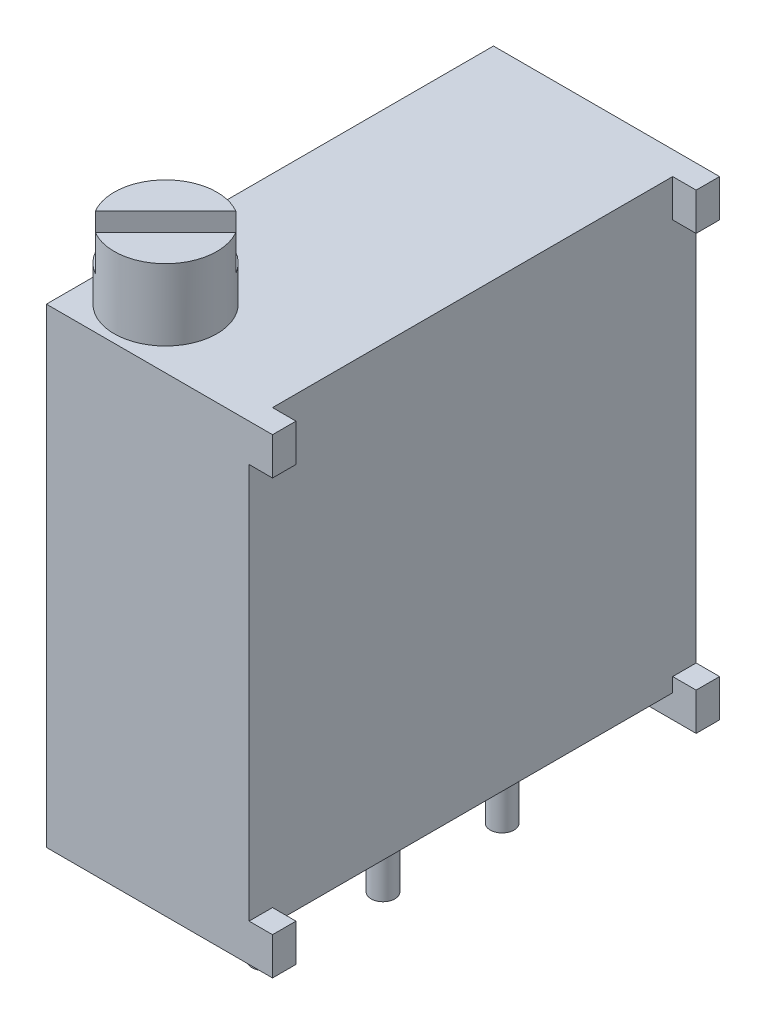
ISO-10303-21;
HEADER;
FILE_DESCRIPTION(('STEP AP214'),'2;1');
FILE_NAME('part.step','',(''),(''),'','','');
FILE_SCHEMA(('AUTOMOTIVE_DESIGN { 1 0 10303 214 1 1 1 1 }'));
ENDSEC;
DATA;
#1=APPLICATION_CONTEXT('core data for automotive mechanical design processes');
#2=APPLICATION_PROTOCOL_DEFINITION('international standard','automotive_design',2000,#1);
#3=PRODUCT_CONTEXT('',#1,'mechanical');
#4=PRODUCT('Part','Part','',(#3));
#5=PRODUCT_RELATED_PRODUCT_CATEGORY('part','',(#4));
#6=PRODUCT_DEFINITION_FORMATION('','',#4);
#7=PRODUCT_DEFINITION_CONTEXT('part definition',#1,'design');
#8=PRODUCT_DEFINITION('design','',#6,#7);
#9=PRODUCT_DEFINITION_SHAPE('','',#8);
#10=(LENGTH_UNIT() NAMED_UNIT(*) SI_UNIT(.MILLI.,.METRE.));
#11=(NAMED_UNIT(*) PLANE_ANGLE_UNIT() SI_UNIT($,.RADIAN.));
#12=(NAMED_UNIT(*) SI_UNIT($,.STERADIAN.) SOLID_ANGLE_UNIT());
#13=UNCERTAINTY_MEASURE_WITH_UNIT(LENGTH_MEASURE(1.E-05),#10,'distance_accuracy_value','');
#14=(GEOMETRIC_REPRESENTATION_CONTEXT(3) GLOBAL_UNCERTAINTY_ASSIGNED_CONTEXT((#13)) GLOBAL_UNIT_ASSIGNED_CONTEXT((#10,
#11,#12)) REPRESENTATION_CONTEXT('',''));
#15=CARTESIAN_POINT('',(0.,0.,0.));
#16=DIRECTION('',(0.,0.,1.));
#17=DIRECTION('',(1.,0.,0.));
#18=AXIS2_PLACEMENT_3D('',#15,#16,#17);
#19=CARTESIAN_POINT('',(-1.14,11.55,0.954999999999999));
#20=DIRECTION('',(0.,1.,0.));
#21=DIRECTION('',(0.,0.,1.));
#22=AXIS2_PLACEMENT_3D('',#19,#20,#21);
#23=PLANE('',#22);
#24=DIRECTION('',(-0.707106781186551,0.,0.707106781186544));
#25=VECTOR('',#24,1.);
#26=CARTESIAN_POINT('',(-1.33798989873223,11.55,0.757010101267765));
#27=LINE('',#26,#25);
#28=CARTESIAN_POINT('',(-0.589449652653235,11.55,0.00846985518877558));
#29=VERTEX_POINT('',#28);
#30=CARTESIAN_POINT('',(-2.08653014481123,11.55,1.50555034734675));
#31=VERTEX_POINT('',#30);
#32=EDGE_CURVE('E186',#29,#31,#27,.T.);
#33=ORIENTED_EDGE('',*,*,#32,.F.);
#34=CARTESIAN_POINT('',(-1.14,11.55,0.954999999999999));
#35=DIRECTION('',(0.,1.,0.));
#36=DIRECTION('',(0.,0.,1.));
#37=AXIS2_PLACEMENT_3D('',#34,#35,#36);
#38=CIRCLE('',#37,1.095);
#39=EDGE_CURVE('E198',#29,#31,#38,.T.);
#40=ORIENTED_EDGE('',*,*,#39,.T.);
#41=EDGE_LOOP('',(#33,#40));
#42=FACE_BOUND('',#41,.T.);
#43=ADVANCED_FACE('F31',(#42),#23,.T.);
#44=CARTESIAN_POINT('',(2.41,10.03,2.225));
#45=DIRECTION('',(0.,-1.,0.));
#46=DIRECTION('',(0.,0.,-1.));
#47=AXIS2_PLACEMENT_3D('',#44,#45,#46);
#48=PLANE('',#47);
#49=DIRECTION('',(1.,0.,0.));
#50=VECTOR('',#49,1.);
#51=CARTESIAN_POINT('',(1.91,10.03,1.725));
#52=LINE('',#51,#50);
#53=CARTESIAN_POINT('',(1.91,10.03,1.725));
#54=VERTEX_POINT('',#53);
#55=CARTESIAN_POINT('',(2.41,10.03,1.725));
#56=VERTEX_POINT('',#55);
#57=EDGE_CURVE('E261',#54,#56,#52,.T.);
#58=ORIENTED_EDGE('',*,*,#57,.F.);
#59=DIRECTION('',(0.,0.,1.));
#60=VECTOR('',#59,1.);
#61=CARTESIAN_POINT('',(1.91,10.03,2.225));
#62=LINE('',#61,#60);
#63=CARTESIAN_POINT('',(1.91,10.03,-6.805));
#64=VERTEX_POINT('',#63);
#65=EDGE_CURVE('E345',#64,#54,#62,.T.);
#66=ORIENTED_EDGE('',*,*,#65,.F.);
#67=DIRECTION('',(1.,0.,0.));
#68=VECTOR('',#67,1.);
#69=CARTESIAN_POINT('',(1.91,10.03,-6.805));
#70=LINE('',#69,#68);
#71=CARTESIAN_POINT('',(2.41,10.03,-6.805));
#72=VERTEX_POINT('',#71);
#73=EDGE_CURVE('E241',#64,#72,#70,.T.);
#74=ORIENTED_EDGE('',*,*,#73,.T.);
#75=DIRECTION('',(0.,0.,1.));
#76=VECTOR('',#75,1.);
#77=CARTESIAN_POINT('',(2.41,10.03,2.225));
#78=LINE('',#77,#76);
#79=CARTESIAN_POINT('',(2.41,10.03,-7.305));
#80=VERTEX_POINT('',#79);
#81=EDGE_CURVE('E326',#80,#72,#78,.T.);
#82=ORIENTED_EDGE('',*,*,#81,.F.);
#83=DIRECTION('',(-1.,0.,0.));
#84=VECTOR('',#83,1.);
#85=CARTESIAN_POINT('',(2.41,10.03,-7.305));
#86=LINE('',#85,#84);
#87=CARTESIAN_POINT('',(-2.41,10.03,-7.305));
#88=VERTEX_POINT('',#87);
#89=EDGE_CURVE('E331',#80,#88,#86,.T.);
#90=ORIENTED_EDGE('',*,*,#89,.T.);
#91=DIRECTION('',(0.,0.,1.));
#92=VECTOR('',#91,1.);
#93=CARTESIAN_POINT('',(-2.41,10.03,2.225));
#94=LINE('',#93,#92);
#95=CARTESIAN_POINT('',(-2.41,10.03,2.225));
#96=VERTEX_POINT('',#95);
#97=EDGE_CURVE('E307',#88,#96,#94,.T.);
#98=ORIENTED_EDGE('',*,*,#97,.T.);
#99=DIRECTION('',(-1.,0.,0.));
#100=VECTOR('',#99,1.);
#101=CARTESIAN_POINT('',(2.41,10.03,2.225));
#102=LINE('',#101,#100);
#103=CARTESIAN_POINT('',(2.41,10.03,2.225));
#104=VERTEX_POINT('',#103);
#105=EDGE_CURVE('E329',#104,#96,#102,.T.);
#106=ORIENTED_EDGE('',*,*,#105,.F.);
#107=EDGE_CURVE('E325',#56,#104,#78,.T.);
#108=ORIENTED_EDGE('',*,*,#107,.F.);
#109=EDGE_LOOP('',(#58,#66,#74,#82,#90,#98,#106,#108));
#110=FACE_BOUND('',#109,.T.);
#111=CARTESIAN_POINT('',(-1.14,10.03,0.954999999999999));
#112=DIRECTION('',(0.,-1.,0.));
#113=DIRECTION('',(0.,0.,-1.));
#114=AXIS2_PLACEMENT_3D('',#111,#112,#113);
#115=CIRCLE('',#114,1.095);
#116=CARTESIAN_POINT('',(-1.14,10.03,-0.140000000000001));
#117=VERTEX_POINT('',#116);
#118=EDGE_CURVE('E187',#117,#117,#115,.F.);
#119=ORIENTED_EDGE('',*,*,#118,.F.);
#120=EDGE_LOOP('',(#119));
#121=FACE_BOUND('',#120,.T.);
#122=ADVANCED_FACE('F372',(#110,#121),#48,.F.);
#123=CARTESIAN_POINT('',(2.41,0.5,1.725));
#124=DIRECTION('',(0.,1.,0.));
#125=DIRECTION('',(0.,0.,1.));
#126=AXIS2_PLACEMENT_3D('',#123,#124,#125);
#127=PLANE('',#126);
#128=CARTESIAN_POINT('',(0.,0.5,-2.54));
#129=DIRECTION('',(0.,1.,0.));
#130=DIRECTION('',(0.,0.,1.));
#131=AXIS2_PLACEMENT_3D('',#128,#129,#130);
#132=CIRCLE('',#131,0.255);
#133=CARTESIAN_POINT('',(0.,0.5,-2.285));
#134=VERTEX_POINT('',#133);
#135=EDGE_CURVE('E350',#134,#134,#132,.F.);
#136=ORIENTED_EDGE('',*,*,#135,.F.);
#137=EDGE_LOOP('',(#136));
#138=FACE_BOUND('',#137,.T.);
#139=DIRECTION('',(0.,0.,-1.));
#140=VECTOR('',#139,1.);
#141=CARTESIAN_POINT('',(1.91,0.5,1.725));
#142=LINE('',#141,#140);
#143=CARTESIAN_POINT('',(1.91,0.5,1.725));
#144=VERTEX_POINT('',#143);
#145=CARTESIAN_POINT('',(1.91,0.5,-6.805));
#146=VERTEX_POINT('',#145);
#147=EDGE_CURVE('E282',#144,#146,#142,.T.);
#148=ORIENTED_EDGE('',*,*,#147,.F.);
#149=DIRECTION('',(-1.,0.,0.));
#150=VECTOR('',#149,1.);
#151=CARTESIAN_POINT('',(2.41,0.5,1.725));
#152=LINE('',#151,#150);
#153=CARTESIAN_POINT('',(-2.41,0.5,1.725));
#154=VERTEX_POINT('',#153);
#155=EDGE_CURVE('E339',#144,#154,#152,.T.);
#156=ORIENTED_EDGE('',*,*,#155,.T.);
#157=DIRECTION('',(0.,0.,-1.));
#158=VECTOR('',#157,1.);
#159=CARTESIAN_POINT('',(-2.41,0.5,1.725));
#160=LINE('',#159,#158);
#161=CARTESIAN_POINT('',(-2.41,0.5,-6.805));
#162=VERTEX_POINT('',#161);
#163=EDGE_CURVE('E295',#154,#162,#160,.T.);
#164=ORIENTED_EDGE('',*,*,#163,.T.);
#165=DIRECTION('',(-1.,0.,0.));
#166=VECTOR('',#165,1.);
#167=CARTESIAN_POINT('',(2.41,0.5,-6.805));
#168=LINE('',#167,#166);
#169=EDGE_CURVE('E337',#146,#162,#168,.T.);
#170=ORIENTED_EDGE('',*,*,#169,.F.);
#171=EDGE_LOOP('',(#148,#156,#164,#170));
#172=FACE_BOUND('',#171,.T.);
#173=CARTESIAN_POINT('',(0.,0.5,0.));
#174=DIRECTION('',(0.,1.,0.));
#175=DIRECTION('',(0.,0.,1.));
#176=AXIS2_PLACEMENT_3D('',#173,#174,#175);
#177=CIRCLE('',#176,0.255);
#178=CARTESIAN_POINT('',(0.,0.5,0.255));
#179=VERTEX_POINT('',#178);
#180=EDGE_CURVE('E347',#179,#179,#177,.F.);
#181=ORIENTED_EDGE('',*,*,#180,.F.);
#182=EDGE_LOOP('',(#181));
#183=FACE_BOUND('',#182,.T.);
#184=CARTESIAN_POINT('',(0.,0.5,-5.08));
#185=DIRECTION('',(0.,1.,0.));
#186=DIRECTION('',(0.,0.,1.));
#187=AXIS2_PLACEMENT_3D('',#184,#185,#186);
#188=CIRCLE('',#187,0.255);
#189=CARTESIAN_POINT('',(0.,0.5,-4.825));
#190=VERTEX_POINT('',#189);
#191=EDGE_CURVE('E353',#190,#190,#188,.F.);
#192=ORIENTED_EDGE('',*,*,#191,.F.);
#193=EDGE_LOOP('',(#192));
#194=FACE_BOUND('',#193,.T.);
#195=ADVANCED_FACE('F377',(#138,#172,#183,#194),#127,.F.);
#196=CARTESIAN_POINT('',(2.41,0.,2.225));
#197=DIRECTION('',(0.,0.,-1.));
#198=DIRECTION('',(-1.,0.,0.));
#199=AXIS2_PLACEMENT_3D('',#196,#197,#198);
#200=PLANE('',#199);
#201=DIRECTION('',(1.,0.,0.));
#202=VECTOR('',#201,1.);
#203=CARTESIAN_POINT('',(1.91,0.8,2.225));
#204=LINE('',#203,#202);
#205=CARTESIAN_POINT('',(1.91,0.8,2.225));
#206=VERTEX_POINT('',#205);
#207=CARTESIAN_POINT('',(2.41,0.8,2.225));
#208=VERTEX_POINT('',#207);
#209=EDGE_CURVE('E276',#206,#208,#204,.T.);
#210=ORIENTED_EDGE('',*,*,#209,.F.);
#211=DIRECTION('',(0.,-1.,0.));
#212=VECTOR('',#211,1.);
#213=CARTESIAN_POINT('',(1.91,0.,2.225));
#214=LINE('',#213,#212);
#215=CARTESIAN_POINT('',(1.91,9.23,2.225));
#216=VERTEX_POINT('',#215);
#217=EDGE_CURVE('E284',#216,#206,#214,.T.);
#218=ORIENTED_EDGE('',*,*,#217,.F.);
#219=DIRECTION('',(1.,0.,0.));
#220=VECTOR('',#219,1.);
#221=CARTESIAN_POINT('',(1.91,9.23,2.225));
#222=LINE('',#221,#220);
#223=CARTESIAN_POINT('',(2.41,9.23,2.225));
#224=VERTEX_POINT('',#223);
#225=EDGE_CURVE('E260',#216,#224,#222,.T.);
#226=ORIENTED_EDGE('',*,*,#225,.T.);
#227=DIRECTION('',(0.,-1.,0.));
#228=VECTOR('',#227,1.);
#229=CARTESIAN_POINT('',(2.41,0.,2.225));
#230=LINE('',#229,#228);
#231=EDGE_CURVE('E311',#104,#224,#230,.T.);
#232=ORIENTED_EDGE('',*,*,#231,.F.);
#233=ORIENTED_EDGE('',*,*,#105,.T.);
#234=DIRECTION('',(0.,-1.,0.));
#235=VECTOR('',#234,1.);
#236=CARTESIAN_POINT('',(-2.41,0.,2.225));
#237=LINE('',#236,#235);
#238=CARTESIAN_POINT('',(-2.41,0.,2.225));
#239=VERTEX_POINT('',#238);
#240=EDGE_CURVE('E286',#96,#239,#237,.T.);
#241=ORIENTED_EDGE('',*,*,#240,.T.);
#242=DIRECTION('',(-1.,0.,0.));
#243=VECTOR('',#242,1.);
#244=CARTESIAN_POINT('',(2.41,0.,2.225));
#245=LINE('',#244,#243);
#246=CARTESIAN_POINT('',(2.41,0.,2.225));
#247=VERTEX_POINT('',#246);
#248=EDGE_CURVE('E343',#247,#239,#245,.T.);
#249=ORIENTED_EDGE('',*,*,#248,.F.);
#250=EDGE_CURVE('E310',#208,#247,#230,.T.);
#251=ORIENTED_EDGE('',*,*,#250,.F.);
#252=EDGE_LOOP('',(#210,#218,#226,#232,#233,#241,#249,#251));
#253=FACE_BOUND('',#252,.T.);
#254=ADVANCED_FACE('F33',(#253),#200,.F.);
#255=CARTESIAN_POINT('',(2.41,0.,-7.305));
#256=DIRECTION('',(0.,0.,1.));
#257=DIRECTION('',(1.,0.,0.));
#258=AXIS2_PLACEMENT_3D('',#255,#256,#257);
#259=PLANE('',#258);
#260=DIRECTION('',(1.,0.,0.));
#261=VECTOR('',#260,1.);
#262=CARTESIAN_POINT('',(1.91,9.23,-7.305));
#263=LINE('',#262,#261);
#264=CARTESIAN_POINT('',(1.91,9.23,-7.305));
#265=VERTEX_POINT('',#264);
#266=CARTESIAN_POINT('',(2.41,9.23,-7.305));
#267=VERTEX_POINT('',#266);
#268=EDGE_CURVE('E242',#265,#267,#263,.T.);
#269=ORIENTED_EDGE('',*,*,#268,.F.);
#270=DIRECTION('',(0.,1.,0.));
#271=VECTOR('',#270,1.);
#272=CARTESIAN_POINT('',(1.91,0.,-7.305));
#273=LINE('',#272,#271);
#274=CARTESIAN_POINT('',(1.91,0.8,-7.305));
#275=VERTEX_POINT('',#274);
#276=EDGE_CURVE('E278',#275,#265,#273,.T.);
#277=ORIENTED_EDGE('',*,*,#276,.F.);
#278=DIRECTION('',(1.,0.,0.));
#279=VECTOR('',#278,1.);
#280=CARTESIAN_POINT('',(1.91,0.8,-7.305));
#281=LINE('',#280,#279);
#282=CARTESIAN_POINT('',(2.41,0.8,-7.305));
#283=VERTEX_POINT('',#282);
#284=EDGE_CURVE('E224',#275,#283,#281,.T.);
#285=ORIENTED_EDGE('',*,*,#284,.T.);
#286=DIRECTION('',(0.,1.,0.));
#287=VECTOR('',#286,1.);
#288=CARTESIAN_POINT('',(2.41,0.,-7.305));
#289=LINE('',#288,#287);
#290=CARTESIAN_POINT('',(2.41,0.,-7.305));
#291=VERTEX_POINT('',#290);
#292=EDGE_CURVE('E322',#291,#283,#289,.T.);
#293=ORIENTED_EDGE('',*,*,#292,.F.);
#294=DIRECTION('',(-1.,0.,0.));
#295=VECTOR('',#294,1.);
#296=CARTESIAN_POINT('',(2.41,0.,-7.305));
#297=LINE('',#296,#295);
#298=CARTESIAN_POINT('',(-2.41,0.,-7.305));
#299=VERTEX_POINT('',#298);
#300=EDGE_CURVE('E333',#291,#299,#297,.T.);
#301=ORIENTED_EDGE('',*,*,#300,.T.);
#302=DIRECTION('',(0.,1.,0.));
#303=VECTOR('',#302,1.);
#304=CARTESIAN_POINT('',(-2.41,0.,-7.305));
#305=LINE('',#304,#303);
#306=EDGE_CURVE('E304',#299,#88,#305,.T.);
#307=ORIENTED_EDGE('',*,*,#306,.T.);
#308=ORIENTED_EDGE('',*,*,#89,.F.);
#309=EDGE_CURVE('E321',#267,#80,#289,.T.);
#310=ORIENTED_EDGE('',*,*,#309,.F.);
#311=EDGE_LOOP('',(#269,#277,#285,#293,#301,#307,#308,#310));
#312=FACE_BOUND('',#311,.T.);
#313=ADVANCED_FACE('F451',(#312),#259,.F.);
#314=CARTESIAN_POINT('',(2.41,10.03,2.225));
#315=DIRECTION('',(-1.,0.,0.));
#316=DIRECTION('',(0.,0.,1.));
#317=AXIS2_PLACEMENT_3D('',#314,#315,#316);
#318=PLANE('',#317);
#319=DIRECTION('',(0.,1.,0.));
#320=VECTOR('',#319,1.);
#321=CARTESIAN_POINT('',(2.41,0.,1.725));
#322=LINE('',#321,#320);
#323=CARTESIAN_POINT('',(2.41,0.,1.725));
#324=VERTEX_POINT('',#323);
#325=CARTESIAN_POINT('',(2.41,0.8,1.725));
#326=VERTEX_POINT('',#325);
#327=EDGE_CURVE('E316',#324,#326,#322,.T.);
#328=ORIENTED_EDGE('',*,*,#327,.T.);
#329=DIRECTION('',(0.,0.,1.));
#330=VECTOR('',#329,1.);
#331=CARTESIAN_POINT('',(2.41,0.8,1.725));
#332=LINE('',#331,#330);
#333=EDGE_CURVE('E263',#326,#208,#332,.T.);
#334=ORIENTED_EDGE('',*,*,#333,.T.);
#335=ORIENTED_EDGE('',*,*,#250,.T.);
#336=DIRECTION('',(0.,0.,-1.));
#337=VECTOR('',#336,1.);
#338=CARTESIAN_POINT('',(2.41,0.,2.225));
#339=LINE('',#338,#337);
#340=EDGE_CURVE('E314',#247,#324,#339,.T.);
#341=ORIENTED_EDGE('',*,*,#340,.T.);
#342=EDGE_LOOP('',(#328,#334,#335,#341));
#343=FACE_BOUND('',#342,.T.);
#344=ADVANCED_FACE('F448',(#343),#318,.F.);
#345=DIRECTION('',(0.,1.,0.));
#346=VECTOR('',#345,1.);
#347=CARTESIAN_POINT('',(2.41,10.03,1.725));
#348=LINE('',#347,#346);
#349=CARTESIAN_POINT('',(2.41,9.23,1.725));
#350=VERTEX_POINT('',#349);
#351=EDGE_CURVE('E251',#350,#56,#348,.T.);
#352=ORIENTED_EDGE('',*,*,#351,.T.);
#353=ORIENTED_EDGE('',*,*,#107,.T.);
#354=ORIENTED_EDGE('',*,*,#231,.T.);
#355=DIRECTION('',(0.,0.,-1.));
#356=VECTOR('',#355,1.);
#357=CARTESIAN_POINT('',(2.41,9.23,2.225));
#358=LINE('',#357,#356);
#359=EDGE_CURVE('E244',#224,#350,#358,.T.);
#360=ORIENTED_EDGE('',*,*,#359,.T.);
#361=EDGE_LOOP('',(#352,#353,#354,#360));
#362=FACE_BOUND('',#361,.T.);
#363=ADVANCED_FACE('F450',(#362),#318,.F.);
#364=DIRECTION('',(0.,0.,-1.));
#365=VECTOR('',#364,1.);
#366=CARTESIAN_POINT('',(2.41,9.23,-7.305));
#367=LINE('',#366,#365);
#368=CARTESIAN_POINT('',(2.41,9.23,-6.805));
#369=VERTEX_POINT('',#368);
#370=EDGE_CURVE('E232',#369,#267,#367,.T.);
#371=ORIENTED_EDGE('',*,*,#370,.T.);
#372=ORIENTED_EDGE('',*,*,#309,.T.);
#373=ORIENTED_EDGE('',*,*,#81,.T.);
#374=DIRECTION('',(0.,-1.,0.));
#375=VECTOR('',#374,1.);
#376=CARTESIAN_POINT('',(2.41,10.03,-6.805));
#377=LINE('',#376,#375);
#378=EDGE_CURVE('E227',#72,#369,#377,.T.);
#379=ORIENTED_EDGE('',*,*,#378,.T.);
#380=EDGE_LOOP('',(#371,#372,#373,#379));
#381=FACE_BOUND('',#380,.T.);
#382=ADVANCED_FACE('F476',(#381),#318,.F.);
#383=DIRECTION('',(0.,0.,1.));
#384=VECTOR('',#383,1.);
#385=CARTESIAN_POINT('',(2.41,0.8,-6.805));
#386=LINE('',#385,#384);
#387=CARTESIAN_POINT('',(2.41,0.8,-6.805));
#388=VERTEX_POINT('',#387);
#389=EDGE_CURVE('E215',#283,#388,#386,.T.);
#390=ORIENTED_EDGE('',*,*,#389,.T.);
#391=DIRECTION('',(0.,-1.,0.));
#392=VECTOR('',#391,1.);
#393=CARTESIAN_POINT('',(2.41,0.,-6.805));
#394=LINE('',#393,#392);
#395=CARTESIAN_POINT('',(2.41,0.,-6.805));
#396=VERTEX_POINT('',#395);
#397=EDGE_CURVE('E54',#388,#396,#394,.T.);
#398=ORIENTED_EDGE('',*,*,#397,.T.);
#399=DIRECTION('',(0.,0.,-1.));
#400=VECTOR('',#399,1.);
#401=CARTESIAN_POINT('',(2.41,0.,-6.805));
#402=LINE('',#401,#400);
#403=EDGE_CURVE('E319',#396,#291,#402,.T.);
#404=ORIENTED_EDGE('',*,*,#403,.T.);
#405=ORIENTED_EDGE('',*,*,#292,.T.);
#406=EDGE_LOOP('',(#390,#398,#404,#405));
#407=FACE_BOUND('',#406,.T.);
#408=ADVANCED_FACE('F453',(#407),#318,.F.);
#409=CARTESIAN_POINT('',(2.41,0.,2.225));
#410=DIRECTION('',(0.,1.,0.));
#411=DIRECTION('',(0.,0.,1.));
#412=AXIS2_PLACEMENT_3D('',#409,#410,#411);
#413=PLANE('',#412);
#414=ORIENTED_EDGE('',*,*,#248,.T.);
#415=DIRECTION('',(0.,0.,-1.));
#416=VECTOR('',#415,1.);
#417=CARTESIAN_POINT('',(-2.41,0.,2.225));
#418=LINE('',#417,#416);
#419=CARTESIAN_POINT('',(-2.41,0.,1.725));
#420=VERTEX_POINT('',#419);
#421=EDGE_CURVE('E289',#239,#420,#418,.T.);
#422=ORIENTED_EDGE('',*,*,#421,.T.);
#423=DIRECTION('',(-1.,0.,0.));
#424=VECTOR('',#423,1.);
#425=CARTESIAN_POINT('',(2.41,0.,1.725));
#426=LINE('',#425,#424);
#427=EDGE_CURVE('E341',#324,#420,#426,.T.);
#428=ORIENTED_EDGE('',*,*,#427,.F.);
#429=ORIENTED_EDGE('',*,*,#340,.F.);
#430=EDGE_LOOP('',(#414,#422,#428,#429));
#431=FACE_BOUND('',#430,.T.);
#432=ADVANCED_FACE('F469',(#431),#413,.F.);
#433=CARTESIAN_POINT('',(2.41,0.,1.725));
#434=DIRECTION('',(0.,0.,1.));
#435=DIRECTION('',(1.,0.,0.));
#436=AXIS2_PLACEMENT_3D('',#433,#434,#435);
#437=PLANE('',#436);
#438=ORIENTED_EDGE('',*,*,#427,.T.);
#439=DIRECTION('',(0.,1.,0.));
#440=VECTOR('',#439,1.);
#441=CARTESIAN_POINT('',(-2.41,0.,1.725));
#442=LINE('',#441,#440);
#443=EDGE_CURVE('E292',#420,#154,#442,.T.);
#444=ORIENTED_EDGE('',*,*,#443,.T.);
#445=ORIENTED_EDGE('',*,*,#155,.F.);
#446=DIRECTION('',(0.,1.,0.));
#447=VECTOR('',#446,1.);
#448=CARTESIAN_POINT('',(1.91,0.,1.725));
#449=LINE('',#448,#447);
#450=CARTESIAN_POINT('',(1.91,0.8,1.725));
#451=VERTEX_POINT('',#450);
#452=EDGE_CURVE('E270',#144,#451,#449,.T.);
#453=ORIENTED_EDGE('',*,*,#452,.T.);
#454=DIRECTION('',(1.,0.,0.));
#455=VECTOR('',#454,1.);
#456=CARTESIAN_POINT('',(1.91,0.8,1.725));
#457=LINE('',#456,#455);
#458=EDGE_CURVE('E275',#451,#326,#457,.T.);
#459=ORIENTED_EDGE('',*,*,#458,.T.);
#460=ORIENTED_EDGE('',*,*,#327,.F.);
#461=EDGE_LOOP('',(#438,#444,#445,#453,#459,#460));
#462=FACE_BOUND('',#461,.T.);
#463=ADVANCED_FACE('F464',(#462),#437,.F.);
#464=CARTESIAN_POINT('',(2.41,0.,-6.805));
#465=DIRECTION('',(0.,0.,-1.));
#466=DIRECTION('',(-1.,0.,0.));
#467=AXIS2_PLACEMENT_3D('',#464,#465,#466);
#468=PLANE('',#467);
#469=ORIENTED_EDGE('',*,*,#397,.F.);
#470=DIRECTION('',(1.,0.,0.));
#471=VECTOR('',#470,1.);
#472=CARTESIAN_POINT('',(1.91,0.8,-6.805));
#473=LINE('',#472,#471);
#474=CARTESIAN_POINT('',(1.91,0.8,-6.805));
#475=VERTEX_POINT('',#474);
#476=EDGE_CURVE('E225',#475,#388,#473,.T.);
#477=ORIENTED_EDGE('',*,*,#476,.F.);
#478=DIRECTION('',(0.,-1.,0.));
#479=VECTOR('',#478,1.);
#480=CARTESIAN_POINT('',(1.91,0.,-6.805));
#481=LINE('',#480,#479);
#482=EDGE_CURVE('E221',#475,#146,#481,.T.);
#483=ORIENTED_EDGE('',*,*,#482,.T.);
#484=ORIENTED_EDGE('',*,*,#169,.T.);
#485=DIRECTION('',(0.,-1.,0.));
#486=VECTOR('',#485,1.);
#487=CARTESIAN_POINT('',(-2.41,0.,-6.805));
#488=LINE('',#487,#486);
#489=CARTESIAN_POINT('',(-2.41,0.,-6.805));
#490=VERTEX_POINT('',#489);
#491=EDGE_CURVE('E298',#162,#490,#488,.T.);
#492=ORIENTED_EDGE('',*,*,#491,.T.);
#493=DIRECTION('',(-1.,0.,0.));
#494=VECTOR('',#493,1.);
#495=CARTESIAN_POINT('',(2.41,0.,-6.805));
#496=LINE('',#495,#494);
#497=EDGE_CURVE('E335',#396,#490,#496,.T.);
#498=ORIENTED_EDGE('',*,*,#497,.F.);
#499=EDGE_LOOP('',(#469,#477,#483,#484,#492,#498));
#500=FACE_BOUND('',#499,.T.);
#501=ADVANCED_FACE('F460',(#500),#468,.F.);
#502=CARTESIAN_POINT('',(2.41,0.,-6.805));
#503=DIRECTION('',(0.,1.,0.));
#504=DIRECTION('',(0.,0.,1.));
#505=AXIS2_PLACEMENT_3D('',#502,#503,#504);
#506=PLANE('',#505);
#507=ORIENTED_EDGE('',*,*,#497,.T.);
#508=DIRECTION('',(0.,0.,-1.));
#509=VECTOR('',#508,1.);
#510=CARTESIAN_POINT('',(-2.41,0.,-6.805));
#511=LINE('',#510,#509);
#512=EDGE_CURVE('E301',#490,#299,#511,.T.);
#513=ORIENTED_EDGE('',*,*,#512,.T.);
#514=ORIENTED_EDGE('',*,*,#300,.F.);
#515=ORIENTED_EDGE('',*,*,#403,.F.);
#516=EDGE_LOOP('',(#507,#513,#514,#515));
#517=FACE_BOUND('',#516,.T.);
#518=ADVANCED_FACE('F446',(#517),#506,.F.);
#519=CARTESIAN_POINT('',(-2.41,10.03,2.225));
#520=DIRECTION('',(-1.,0.,0.));
#521=DIRECTION('',(0.,0.,1.));
#522=AXIS2_PLACEMENT_3D('',#519,#520,#521);
#523=PLANE('',#522);
#524=ORIENTED_EDGE('',*,*,#240,.F.);
#525=ORIENTED_EDGE('',*,*,#97,.F.);
#526=ORIENTED_EDGE('',*,*,#306,.F.);
#527=ORIENTED_EDGE('',*,*,#512,.F.);
#528=ORIENTED_EDGE('',*,*,#491,.F.);
#529=ORIENTED_EDGE('',*,*,#163,.F.);
#530=ORIENTED_EDGE('',*,*,#443,.F.);
#531=ORIENTED_EDGE('',*,*,#421,.F.);
#532=EDGE_LOOP('',(#524,#525,#526,#527,#528,#529,#530,#531));
#533=FACE_BOUND('',#532,.T.);
#534=ADVANCED_FACE('F442',(#533),#523,.T.);
#535=CARTESIAN_POINT('',(1.91,5.015,-2.54));
#536=DIRECTION('',(1.,0.,0.));
#537=DIRECTION('',(0.,0.,-1.));
#538=AXIS2_PLACEMENT_3D('',#535,#536,#537);
#539=PLANE('',#538);
#540=ORIENTED_EDGE('',*,*,#217,.T.);
#541=DIRECTION('',(0.,0.,1.));
#542=VECTOR('',#541,1.);
#543=CARTESIAN_POINT('',(1.91,0.8,1.725));
#544=LINE('',#543,#542);
#545=EDGE_CURVE('E272',#451,#206,#544,.T.);
#546=ORIENTED_EDGE('',*,*,#545,.F.);
#547=ORIENTED_EDGE('',*,*,#452,.F.);
#548=ORIENTED_EDGE('',*,*,#147,.T.);
#549=ORIENTED_EDGE('',*,*,#482,.F.);
#550=DIRECTION('',(0.,0.,1.));
#551=VECTOR('',#550,1.);
#552=CARTESIAN_POINT('',(1.91,0.8,-6.805));
#553=LINE('',#552,#551);
#554=EDGE_CURVE('E218',#275,#475,#553,.T.);
#555=ORIENTED_EDGE('',*,*,#554,.F.);
#556=ORIENTED_EDGE('',*,*,#276,.T.);
#557=DIRECTION('',(0.,0.,-1.));
#558=VECTOR('',#557,1.);
#559=CARTESIAN_POINT('',(1.91,9.23,-7.305));
#560=LINE('',#559,#558);
#561=CARTESIAN_POINT('',(1.91,9.23,-6.805));
#562=VERTEX_POINT('',#561);
#563=EDGE_CURVE('E238',#562,#265,#560,.T.);
#564=ORIENTED_EDGE('',*,*,#563,.F.);
#565=DIRECTION('',(0.,-1.,0.));
#566=VECTOR('',#565,1.);
#567=CARTESIAN_POINT('',(1.91,10.03,-6.805));
#568=LINE('',#567,#566);
#569=EDGE_CURVE('E235',#64,#562,#568,.T.);
#570=ORIENTED_EDGE('',*,*,#569,.F.);
#571=ORIENTED_EDGE('',*,*,#65,.T.);
#572=DIRECTION('',(0.,1.,0.));
#573=VECTOR('',#572,1.);
#574=CARTESIAN_POINT('',(1.91,10.03,1.725));
#575=LINE('',#574,#573);
#576=CARTESIAN_POINT('',(1.91,9.23,1.725));
#577=VERTEX_POINT('',#576);
#578=EDGE_CURVE('E257',#577,#54,#575,.T.);
#579=ORIENTED_EDGE('',*,*,#578,.F.);
#580=DIRECTION('',(0.,0.,-1.));
#581=VECTOR('',#580,1.);
#582=CARTESIAN_POINT('',(1.91,9.23,2.225));
#583=LINE('',#582,#581);
#584=EDGE_CURVE('E254',#216,#577,#583,.T.);
#585=ORIENTED_EDGE('',*,*,#584,.F.);
#586=EDGE_LOOP('',(#540,#546,#547,#548,#549,#555,#556,#564,#570,#571,#579,#585));
#587=FACE_BOUND('',#586,.T.);
#588=ADVANCED_FACE('F438',(#587),#539,.T.);
#589=CARTESIAN_POINT('',(1.91,0.8,1.725));
#590=DIRECTION('',(0.,1.,0.));
#591=DIRECTION('',(0.,0.,1.));
#592=AXIS2_PLACEMENT_3D('',#589,#590,#591);
#593=PLANE('',#592);
#594=ORIENTED_EDGE('',*,*,#333,.F.);
#595=ORIENTED_EDGE('',*,*,#458,.F.);
#596=ORIENTED_EDGE('',*,*,#545,.T.);
#597=ORIENTED_EDGE('',*,*,#209,.T.);
#598=EDGE_LOOP('',(#594,#595,#596,#597));
#599=FACE_BOUND('',#598,.T.);
#600=ADVANCED_FACE('F431',(#599),#593,.T.);
#601=CARTESIAN_POINT('',(1.91,10.03,1.725));
#602=DIRECTION('',(0.,0.,-1.));
#603=DIRECTION('',(-1.,0.,0.));
#604=AXIS2_PLACEMENT_3D('',#601,#602,#603);
#605=PLANE('',#604);
#606=ORIENTED_EDGE('',*,*,#351,.F.);
#607=DIRECTION('',(1.,0.,0.));
#608=VECTOR('',#607,1.);
#609=CARTESIAN_POINT('',(1.91,9.23,1.725));
#610=LINE('',#609,#608);
#611=EDGE_CURVE('E264',#577,#350,#610,.T.);
#612=ORIENTED_EDGE('',*,*,#611,.F.);
#613=ORIENTED_EDGE('',*,*,#578,.T.);
#614=ORIENTED_EDGE('',*,*,#57,.T.);
#615=EDGE_LOOP('',(#606,#612,#613,#614));
#616=FACE_BOUND('',#615,.T.);
#617=ADVANCED_FACE('F428',(#616),#605,.T.);
#618=CARTESIAN_POINT('',(1.91,9.23,2.225));
#619=DIRECTION('',(0.,-1.,0.));
#620=DIRECTION('',(0.,0.,-1.));
#621=AXIS2_PLACEMENT_3D('',#618,#619,#620);
#622=PLANE('',#621);
#623=ORIENTED_EDGE('',*,*,#359,.F.);
#624=ORIENTED_EDGE('',*,*,#225,.F.);
#625=ORIENTED_EDGE('',*,*,#584,.T.);
#626=ORIENTED_EDGE('',*,*,#611,.T.);
#627=EDGE_LOOP('',(#623,#624,#625,#626));
#628=FACE_BOUND('',#627,.T.);
#629=ADVANCED_FACE('F423',(#628),#622,.T.);
#630=CARTESIAN_POINT('',(1.91,9.23,-7.305));
#631=DIRECTION('',(0.,-1.,0.));
#632=DIRECTION('',(0.,0.,-1.));
#633=AXIS2_PLACEMENT_3D('',#630,#631,#632);
#634=PLANE('',#633);
#635=ORIENTED_EDGE('',*,*,#370,.F.);
#636=DIRECTION('',(1.,0.,0.));
#637=VECTOR('',#636,1.);
#638=CARTESIAN_POINT('',(1.91,9.23,-6.805));
#639=LINE('',#638,#637);
#640=EDGE_CURVE('E245',#562,#369,#639,.T.);
#641=ORIENTED_EDGE('',*,*,#640,.F.);
#642=ORIENTED_EDGE('',*,*,#563,.T.);
#643=ORIENTED_EDGE('',*,*,#268,.T.);
#644=EDGE_LOOP('',(#635,#641,#642,#643));
#645=FACE_BOUND('',#644,.T.);
#646=ADVANCED_FACE('F420',(#645),#634,.T.);
#647=CARTESIAN_POINT('',(1.91,10.03,-6.805));
#648=DIRECTION('',(0.,0.,1.));
#649=DIRECTION('',(1.,0.,0.));
#650=AXIS2_PLACEMENT_3D('',#647,#648,#649);
#651=PLANE('',#650);
#652=ORIENTED_EDGE('',*,*,#378,.F.);
#653=ORIENTED_EDGE('',*,*,#73,.F.);
#654=ORIENTED_EDGE('',*,*,#569,.T.);
#655=ORIENTED_EDGE('',*,*,#640,.T.);
#656=EDGE_LOOP('',(#652,#653,#654,#655));
#657=FACE_BOUND('',#656,.T.);
#658=ADVANCED_FACE('F418',(#657),#651,.T.);
#659=CARTESIAN_POINT('',(1.91,0.8,-6.805));
#660=DIRECTION('',(0.,1.,0.));
#661=DIRECTION('',(0.,0.,1.));
#662=AXIS2_PLACEMENT_3D('',#659,#660,#661);
#663=PLANE('',#662);
#664=ORIENTED_EDGE('',*,*,#389,.F.);
#665=ORIENTED_EDGE('',*,*,#284,.F.);
#666=ORIENTED_EDGE('',*,*,#554,.T.);
#667=ORIENTED_EDGE('',*,*,#476,.T.);
#668=EDGE_LOOP('',(#664,#665,#666,#667));
#669=FACE_BOUND('',#668,.T.);
#670=ADVANCED_FACE('F414',(#669),#663,.T.);
#671=CARTESIAN_POINT('',(0.,-2.,0.));
#672=DIRECTION('',(0.,1.,0.));
#673=DIRECTION('',(0.,0.,1.));
#674=AXIS2_PLACEMENT_3D('',#671,#672,#673);
#675=CYLINDRICAL_SURFACE('',#674,0.255);
#676=CARTESIAN_POINT('',(0.,-2.,0.));
#677=DIRECTION('',(0.,-1.,0.));
#678=DIRECTION('',(0.,0.,-1.));
#679=AXIS2_PLACEMENT_3D('',#676,#677,#678);
#680=CIRCLE('',#679,0.255);
#681=CARTESIAN_POINT('',(0.,-2.,-0.255));
#682=VERTEX_POINT('',#681);
#683=EDGE_CURVE('E212',#682,#682,#680,.T.);
#684=ORIENTED_EDGE('',*,*,#683,.F.);
#685=EDGE_LOOP('',(#684));
#686=FACE_BOUND('',#685,.T.);
#687=ORIENTED_EDGE('',*,*,#180,.T.);
#688=EDGE_LOOP('',(#687));
#689=FACE_BOUND('',#688,.T.);
#690=ADVANCED_FACE('F410',(#686,#689),#675,.T.);
#691=CARTESIAN_POINT('',(0.,-2.,0.));
#692=DIRECTION('',(0.,-1.,0.));
#693=DIRECTION('',(0.,0.,-1.));
#694=AXIS2_PLACEMENT_3D('',#691,#692,#693);
#695=PLANE('',#694);
#696=ORIENTED_EDGE('',*,*,#683,.T.);
#697=EDGE_LOOP('',(#696));
#698=FACE_BOUND('',#697,.T.);
#699=ADVANCED_FACE('F406',(#698),#695,.T.);
#700=CARTESIAN_POINT('',(0.,-2.,-2.54));
#701=DIRECTION('',(0.,1.,0.));
#702=DIRECTION('',(0.,0.,1.));
#703=AXIS2_PLACEMENT_3D('',#700,#701,#702);
#704=CYLINDRICAL_SURFACE('',#703,0.255);
#705=CARTESIAN_POINT('',(0.,-2.,-2.54));
#706=DIRECTION('',(0.,-1.,0.));
#707=DIRECTION('',(0.,0.,-1.));
#708=AXIS2_PLACEMENT_3D('',#705,#706,#707);
#709=CIRCLE('',#708,0.255);
#710=CARTESIAN_POINT('',(0.,-2.,-2.795));
#711=VERTEX_POINT('',#710);
#712=EDGE_CURVE('E209',#711,#711,#709,.T.);
#713=ORIENTED_EDGE('',*,*,#712,.F.);
#714=EDGE_LOOP('',(#713));
#715=FACE_BOUND('',#714,.T.);
#716=ORIENTED_EDGE('',*,*,#135,.T.);
#717=EDGE_LOOP('',(#716));
#718=FACE_BOUND('',#717,.T.);
#719=ADVANCED_FACE('F402',(#715,#718),#704,.T.);
#720=CARTESIAN_POINT('',(0.,-2.,-2.54));
#721=DIRECTION('',(0.,-1.,0.));
#722=DIRECTION('',(0.,0.,-1.));
#723=AXIS2_PLACEMENT_3D('',#720,#721,#722);
#724=PLANE('',#723);
#725=ORIENTED_EDGE('',*,*,#712,.T.);
#726=EDGE_LOOP('',(#725));
#727=FACE_BOUND('',#726,.T.);
#728=ADVANCED_FACE('F398',(#727),#724,.T.);
#729=CARTESIAN_POINT('',(0.,-2.,-5.08));
#730=DIRECTION('',(0.,1.,0.));
#731=DIRECTION('',(0.,0.,1.));
#732=AXIS2_PLACEMENT_3D('',#729,#730,#731);
#733=CYLINDRICAL_SURFACE('',#732,0.255);
#734=CARTESIAN_POINT('',(0.,-2.,-5.08));
#735=DIRECTION('',(0.,-1.,0.));
#736=DIRECTION('',(0.,0.,-1.));
#737=AXIS2_PLACEMENT_3D('',#734,#735,#736);
#738=CIRCLE('',#737,0.255);
#739=CARTESIAN_POINT('',(0.,-2.,-5.335));
#740=VERTEX_POINT('',#739);
#741=EDGE_CURVE('E202',#740,#740,#738,.T.);
#742=ORIENTED_EDGE('',*,*,#741,.F.);
#743=EDGE_LOOP('',(#742));
#744=FACE_BOUND('',#743,.T.);
#745=ORIENTED_EDGE('',*,*,#191,.T.);
#746=EDGE_LOOP('',(#745));
#747=FACE_BOUND('',#746,.T.);
#748=ADVANCED_FACE('F392',(#744,#747),#733,.T.);
#749=CARTESIAN_POINT('',(0.,-2.,-5.08));
#750=DIRECTION('',(0.,-1.,0.));
#751=DIRECTION('',(0.,0.,-1.));
#752=AXIS2_PLACEMENT_3D('',#749,#750,#751);
#753=PLANE('',#752);
#754=ORIENTED_EDGE('',*,*,#741,.T.);
#755=EDGE_LOOP('',(#754));
#756=FACE_BOUND('',#755,.T.);
#757=ADVANCED_FACE('F388',(#756),#753,.T.);
#758=CARTESIAN_POINT('',(-1.14,11.55,0.954999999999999));
#759=DIRECTION('',(0.,-1.,0.));
#760=DIRECTION('',(0.,0.,-1.));
#761=AXIS2_PLACEMENT_3D('',#758,#759,#760);
#762=CYLINDRICAL_SURFACE('',#761,1.095);
#763=ORIENTED_EDGE('',*,*,#39,.F.);
#764=DIRECTION('',(0.,-1.,0.));
#765=VECTOR('',#764,1.);
#766=CARTESIAN_POINT('',(-0.589449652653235,11.55,0.0084698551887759));
#767=LINE('',#766,#765);
#768=CARTESIAN_POINT('',(-0.589449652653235,10.79,0.00846985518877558));
#769=VERTEX_POINT('',#768);
#770=EDGE_CURVE('E199',#29,#769,#767,.T.);
#771=ORIENTED_EDGE('',*,*,#770,.T.);
#772=CARTESIAN_POINT('',(-1.14,10.79,0.954999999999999));
#773=DIRECTION('',(0.,-1.,0.));
#774=DIRECTION('',(0.,0.,-1.));
#775=AXIS2_PLACEMENT_3D('',#772,#773,#774);
#776=CIRCLE('',#775,1.095);
#777=CARTESIAN_POINT('',(-0.193469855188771,10.79,0.404449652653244));
#778=VERTEX_POINT('',#777);
#779=EDGE_CURVE('E12',#769,#778,#776,.T.);
#780=ORIENTED_EDGE('',*,*,#779,.T.);
#781=DIRECTION('',(0.,-1.,0.));
#782=VECTOR('',#781,1.);
#783=CARTESIAN_POINT('',(-0.193469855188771,11.55,0.404449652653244));
#784=LINE('',#783,#782);
#785=CARTESIAN_POINT('',(-0.193469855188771,11.55,0.404449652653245));
#786=VERTEX_POINT('',#785);
#787=EDGE_CURVE('E181',#778,#786,#784,.F.);
#788=ORIENTED_EDGE('',*,*,#787,.T.);
#789=CARTESIAN_POINT('',(-1.69055034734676,11.55,1.90153014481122));
#790=VERTEX_POINT('',#789);
#791=EDGE_CURVE('E193',#790,#786,#38,.T.);
#792=ORIENTED_EDGE('',*,*,#791,.F.);
#793=DIRECTION('',(0.,-1.,0.));
#794=VECTOR('',#793,1.);
#795=CARTESIAN_POINT('',(-1.69055034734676,11.55,1.90153014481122));
#796=LINE('',#795,#794);
#797=CARTESIAN_POINT('',(-1.69055034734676,10.79,1.90153014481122));
#798=VERTEX_POINT('',#797);
#799=EDGE_CURVE('E46',#790,#798,#796,.T.);
#800=ORIENTED_EDGE('',*,*,#799,.T.);
#801=CARTESIAN_POINT('',(-2.08653014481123,10.79,1.50555034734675));
#802=VERTEX_POINT('',#801);
#803=EDGE_CURVE('E35',#798,#802,#776,.T.);
#804=ORIENTED_EDGE('',*,*,#803,.T.);
#805=DIRECTION('',(0.,-1.,0.));
#806=VECTOR('',#805,1.);
#807=CARTESIAN_POINT('',(-2.08653014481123,11.55,1.50555034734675));
#808=LINE('',#807,#806);
#809=EDGE_CURVE('E203',#802,#31,#808,.F.);
#810=ORIENTED_EDGE('',*,*,#809,.T.);
#811=EDGE_LOOP('',(#763,#771,#780,#788,#792,#800,#804,#810));
#812=FACE_BOUND('',#811,.T.);
#813=ORIENTED_EDGE('',*,*,#118,.T.);
#814=EDGE_LOOP('',(#813));
#815=FACE_BOUND('',#814,.T.);
#816=ADVANCED_FACE('F191',(#812,#815),#762,.T.);
#817=DIRECTION('',(0.707106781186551,0.,-0.707106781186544));
#818=VECTOR('',#817,1.);
#819=CARTESIAN_POINT('',(-0.942010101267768,11.55,1.15298989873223));
#820=LINE('',#819,#818);
#821=EDGE_CURVE('E178',#790,#786,#820,.T.);
#822=ORIENTED_EDGE('',*,*,#821,.F.);
#823=ORIENTED_EDGE('',*,*,#791,.T.);
#824=EDGE_LOOP('',(#822,#823));
#825=FACE_BOUND('',#824,.T.);
#826=ADVANCED_FACE('F197',(#825),#23,.T.);
#827=CARTESIAN_POINT('',(-2.11227182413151,10.79,1.53129202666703));
#828=DIRECTION('',(0.,-1.,0.));
#829=DIRECTION('',(0.,0.,-1.));
#830=AXIS2_PLACEMENT_3D('',#827,#828,#829);
#831=PLANE('',#830);
#832=DIRECTION('',(-0.707106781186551,0.,0.707106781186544));
#833=VECTOR('',#832,1.);
#834=CARTESIAN_POINT('',(-2.11227182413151,10.79,1.53129202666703));
#835=LINE('',#834,#833);
#836=EDGE_CURVE('E195',#769,#802,#835,.T.);
#837=ORIENTED_EDGE('',*,*,#836,.T.);
#838=ORIENTED_EDGE('',*,*,#803,.F.);
#839=DIRECTION('',(0.707106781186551,0.,-0.707106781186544));
#840=VECTOR('',#839,1.);
#841=CARTESIAN_POINT('',(-1.71629202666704,10.79,1.9272718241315));
#842=LINE('',#841,#840);
#843=EDGE_CURVE('E364',#798,#778,#842,.T.);
#844=ORIENTED_EDGE('',*,*,#843,.T.);
#845=ORIENTED_EDGE('',*,*,#779,.F.);
#846=EDGE_LOOP('',(#837,#838,#844,#845));
#847=FACE_BOUND('',#846,.T.);
#848=ADVANCED_FACE('F363',(#847),#831,.F.);
#849=CARTESIAN_POINT('',(-2.11227182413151,10.79,1.53129202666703));
#850=DIRECTION('',(-0.707106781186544,0.,-0.707106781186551));
#851=DIRECTION('',(-0.707106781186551,0.,0.707106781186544));
#852=AXIS2_PLACEMENT_3D('',#849,#850,#851);
#853=PLANE('',#852);
#854=ORIENTED_EDGE('',*,*,#32,.T.);
#855=ORIENTED_EDGE('',*,*,#809,.F.);
#856=ORIENTED_EDGE('',*,*,#836,.F.);
#857=ORIENTED_EDGE('',*,*,#770,.F.);
#858=EDGE_LOOP('',(#854,#855,#856,#857));
#859=FACE_BOUND('',#858,.T.);
#860=ADVANCED_FACE('F369',(#859),#853,.F.);
#861=CARTESIAN_POINT('',(-1.71629202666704,10.79,1.9272718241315));
#862=DIRECTION('',(0.707106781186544,0.,0.707106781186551));
#863=DIRECTION('',(0.707106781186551,0.,-0.707106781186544));
#864=AXIS2_PLACEMENT_3D('',#861,#862,#863);
#865=PLANE('',#864);
#866=ORIENTED_EDGE('',*,*,#821,.T.);
#867=ORIENTED_EDGE('',*,*,#787,.F.);
#868=ORIENTED_EDGE('',*,*,#843,.F.);
#869=ORIENTED_EDGE('',*,*,#799,.F.);
#870=EDGE_LOOP('',(#866,#867,#868,#869));
#871=FACE_BOUND('',#870,.T.);
#872=ADVANCED_FACE('F180',(#871),#865,.F.);
#873=CLOSED_SHELL('',(#43,#122,#195,#254,#313,#344,#363,#382,#408,#432,#463,#501,#518,#534,#588,
#600,#617,#629,#646,#658,#670,#690,#699,#719,#728,#748,#757,#816,#826,#848,#860,#872));
#874=MANIFOLD_SOLID_BREP('B2',#873);
#875=ADVANCED_BREP_SHAPE_REPRESENTATION('',(#18,#874),#14);
#876=SHAPE_DEFINITION_REPRESENTATION(#9,#875);
ENDSEC;
END-ISO-10303-21;
